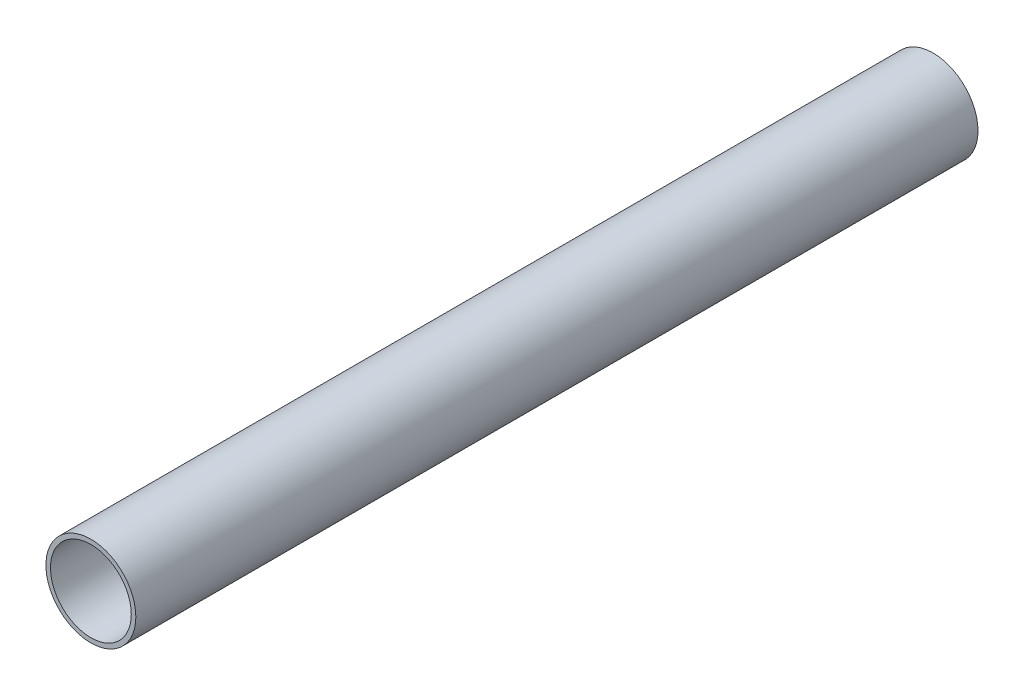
from build123d import *

# Parameters (mm, degrees)
SKETCH1_R           = 5.0165
SKETCH1_R_2         = 4.5085
BOSS_EXTRUDE1_DEPTH = 93.98


with BuildPart() as part:
    # Sketch1 → Boss-Extrude1 (new body)
    with BuildSketch(Plane.XY):
        with Locations((-54.402839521, 21.626281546)):
            Circle(SKETCH1_R)
        with Locations((-54.402839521, 21.626281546)):
            Circle(SKETCH1_R_2, mode=Mode.SUBTRACT)
    extrude(amount=BOSS_EXTRUDE1_DEPTH)


solid = part.part
